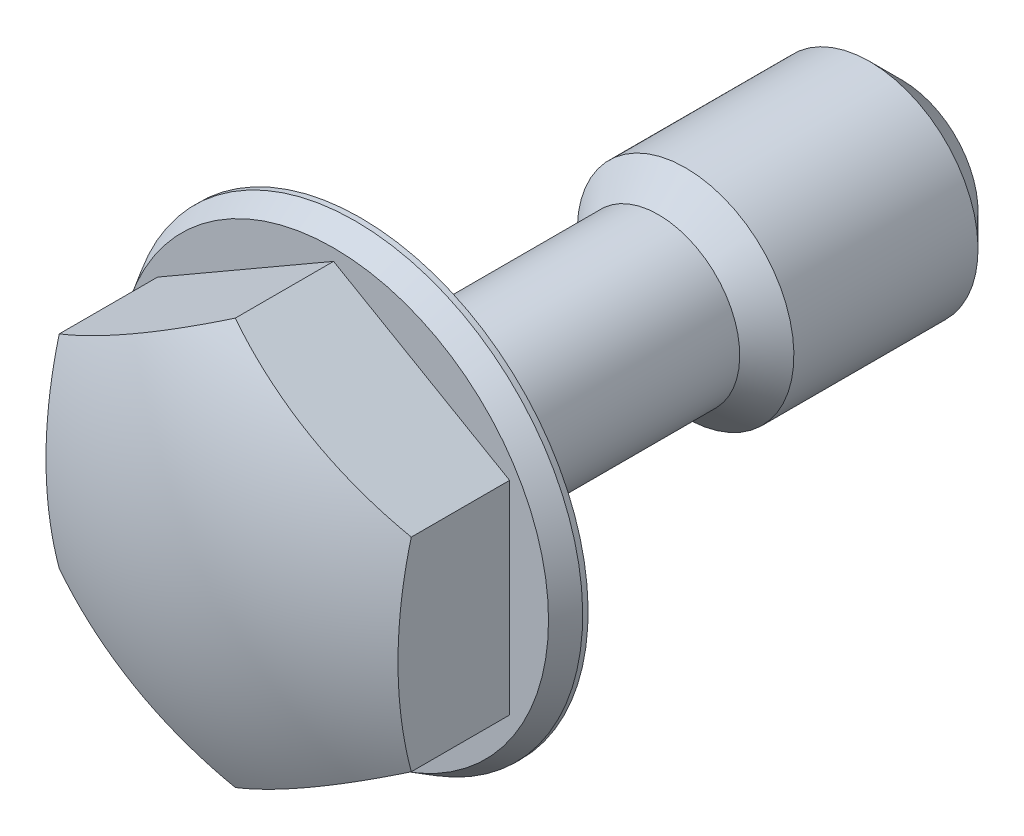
ISO-10303-21;
HEADER;
FILE_DESCRIPTION(('STEP AP214'),'2;1');
FILE_NAME('part.step','',(''),(''),'','','');
FILE_SCHEMA(('AUTOMOTIVE_DESIGN { 1 0 10303 214 1 1 1 1 }'));
ENDSEC;
DATA;
#1=APPLICATION_CONTEXT('core data for automotive mechanical design processes');
#2=APPLICATION_PROTOCOL_DEFINITION('international standard','automotive_design',2000,#1);
#3=PRODUCT_CONTEXT('',#1,'mechanical');
#4=PRODUCT('Part','Part','',(#3));
#5=PRODUCT_RELATED_PRODUCT_CATEGORY('part','',(#4));
#6=PRODUCT_DEFINITION_FORMATION('','',#4);
#7=PRODUCT_DEFINITION_CONTEXT('part definition',#1,'design');
#8=PRODUCT_DEFINITION('design','',#6,#7);
#9=PRODUCT_DEFINITION_SHAPE('','',#8);
#10=(LENGTH_UNIT() NAMED_UNIT(*) SI_UNIT(.MILLI.,.METRE.));
#11=(NAMED_UNIT(*) PLANE_ANGLE_UNIT() SI_UNIT($,.RADIAN.));
#12=(NAMED_UNIT(*) SI_UNIT($,.STERADIAN.) SOLID_ANGLE_UNIT());
#13=UNCERTAINTY_MEASURE_WITH_UNIT(LENGTH_MEASURE(1.E-05),#10,'distance_accuracy_value','');
#14=(GEOMETRIC_REPRESENTATION_CONTEXT(3) GLOBAL_UNCERTAINTY_ASSIGNED_CONTEXT((#13)) GLOBAL_UNIT_ASSIGNED_CONTEXT((#10,
#11,#12)) REPRESENTATION_CONTEXT('',''));
#15=CARTESIAN_POINT('',(0.,0.,0.));
#16=DIRECTION('',(0.,0.,1.));
#17=DIRECTION('',(1.,0.,0.));
#18=AXIS2_PLACEMENT_3D('',#15,#16,#17);
#19=CARTESIAN_POINT('',(0.,0.,1.));
#20=DIRECTION('',(0.,0.,-1.));
#21=DIRECTION('',(0.,1.,0.));
#22=AXIS2_PLACEMENT_3D('',#19,#20,#21);
#23=CONICAL_SURFACE('',#22,7.9381197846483,0.523598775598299);
#24=CARTESIAN_POINT('',(0.,0.,0.2));
#25=DIRECTION('',(0.,0.,-1.));
#26=DIRECTION('',(0.,1.,0.));
#27=AXIS2_PLACEMENT_3D('',#24,#25,#26);
#28=CIRCLE('',#27,8.4);
#29=CARTESIAN_POINT('',(0.,8.4,0.2));
#30=VERTEX_POINT('',#29);
#31=EDGE_CURVE('E117',#30,#30,#28,.T.);
#32=ORIENTED_EDGE('',*,*,#31,.F.);
#33=EDGE_LOOP('',(#32));
#34=FACE_BOUND('',#33,.T.);
#35=CARTESIAN_POINT('',(0.,0.,1.));
#36=DIRECTION('',(0.,0.,1.));
#37=DIRECTION('',(0.,-1.,0.));
#38=AXIS2_PLACEMENT_3D('',#35,#36,#37);
#39=CIRCLE('',#38,7.9381197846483);
#40=CARTESIAN_POINT('',(0.,-7.9381197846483,1.));
#41=VERTEX_POINT('',#40);
#42=EDGE_CURVE('E95',#41,#41,#39,.T.);
#43=ORIENTED_EDGE('',*,*,#42,.F.);
#44=EDGE_LOOP('',(#43));
#45=FACE_BOUND('',#44,.T.);
#46=ADVANCED_FACE('F14',(#34,#45),#23,.T.);
#47=CARTESIAN_POINT('',(0.,0.,-20.));
#48=DIRECTION('',(0.,0.,-1.));
#49=DIRECTION('',(0.,1.,0.));
#50=AXIS2_PLACEMENT_3D('',#47,#48,#49);
#51=CYLINDRICAL_SURFACE('',#50,8.4);
#52=CARTESIAN_POINT('',(0.,0.,0.));
#53=DIRECTION('',(0.,0.,-1.));
#54=DIRECTION('',(0.,1.,0.));
#55=AXIS2_PLACEMENT_3D('',#52,#53,#54);
#56=CIRCLE('',#55,8.4);
#57=CARTESIAN_POINT('',(0.,8.4,0.));
#58=VERTEX_POINT('',#57);
#59=EDGE_CURVE('E114',#58,#58,#56,.T.);
#60=ORIENTED_EDGE('',*,*,#59,.F.);
#61=EDGE_LOOP('',(#60));
#62=FACE_BOUND('',#61,.T.);
#63=ORIENTED_EDGE('',*,*,#31,.T.);
#64=EDGE_LOOP('',(#63));
#65=FACE_BOUND('',#64,.T.);
#66=ADVANCED_FACE('F150',(#62,#65),#51,.T.);
#67=CARTESIAN_POINT('',(8.4,0.,0.));
#68=DIRECTION('',(0.,0.,1.));
#69=DIRECTION('',(0.,-1.,0.));
#70=AXIS2_PLACEMENT_3D('',#67,#68,#69);
#71=PLANE('',#70);
#72=CARTESIAN_POINT('',(0.,0.,0.));
#73=DIRECTION('',(0.,0.,-1.));
#74=DIRECTION('',(0.,1.,0.));
#75=AXIS2_PLACEMENT_3D('',#72,#73,#74);
#76=CIRCLE('',#75,3.6);
#77=CARTESIAN_POINT('',(0.,3.6,0.));
#78=VERTEX_POINT('',#77);
#79=EDGE_CURVE('E111',#78,#78,#76,.T.);
#80=ORIENTED_EDGE('',*,*,#79,.F.);
#81=EDGE_LOOP('',(#80));
#82=FACE_BOUND('',#81,.T.);
#83=ORIENTED_EDGE('',*,*,#59,.T.);
#84=EDGE_LOOP('',(#83));
#85=FACE_BOUND('',#84,.T.);
#86=ADVANCED_FACE('F156',(#82,#85),#71,.F.);
#87=CARTESIAN_POINT('',(0.,0.,-0.6));
#88=DIRECTION('',(0.,0.,-1.));
#89=DIRECTION('',(0.,1.,0.));
#90=AXIS2_PLACEMENT_3D('',#87,#88,#89);
#91=TOROIDAL_SURFACE('',#90,3.6,0.6);
#92=CARTESIAN_POINT('',(0.,0.,-0.6));
#93=DIRECTION('',(0.,0.,-1.));
#94=DIRECTION('',(0.,1.,0.));
#95=AXIS2_PLACEMENT_3D('',#92,#93,#94);
#96=CIRCLE('',#95,3.);
#97=CARTESIAN_POINT('',(0.,3.,-0.6));
#98=VERTEX_POINT('',#97);
#99=EDGE_CURVE('E108',#98,#98,#96,.T.);
#100=ORIENTED_EDGE('',*,*,#99,.F.);
#101=EDGE_LOOP('',(#100));
#102=FACE_BOUND('',#101,.T.);
#103=ORIENTED_EDGE('',*,*,#79,.T.);
#104=EDGE_LOOP('',(#103));
#105=FACE_BOUND('',#104,.T.);
#106=ADVANCED_FACE('F194',(#102,#105),#91,.F.);
#107=CARTESIAN_POINT('',(0.,0.,-20.));
#108=DIRECTION('',(0.,0.,-1.));
#109=DIRECTION('',(0.,1.,0.));
#110=AXIS2_PLACEMENT_3D('',#107,#108,#109);
#111=CYLINDRICAL_SURFACE('',#110,3.);
#112=CARTESIAN_POINT('',(0.,0.,-11.));
#113=DIRECTION('',(0.,0.,-1.));
#114=DIRECTION('',(0.,1.,0.));
#115=AXIS2_PLACEMENT_3D('',#112,#113,#114);
#116=CIRCLE('',#115,3.);
#117=CARTESIAN_POINT('',(0.,3.,-11.));
#118=VERTEX_POINT('',#117);
#119=EDGE_CURVE('E83',#118,#118,#116,.T.);
#120=ORIENTED_EDGE('',*,*,#119,.F.);
#121=EDGE_LOOP('',(#120));
#122=FACE_BOUND('',#121,.T.);
#123=ORIENTED_EDGE('',*,*,#99,.T.);
#124=EDGE_LOOP('',(#123));
#125=FACE_BOUND('',#124,.T.);
#126=ADVANCED_FACE('F191',(#122,#125),#111,.T.);
#127=CARTESIAN_POINT('',(0.,0.,1.));
#128=DIRECTION('',(0.,0.,1.));
#129=DIRECTION('',(0.,-1.,0.));
#130=AXIS2_PLACEMENT_3D('',#127,#128,#129);
#131=PLANE('',#130);
#132=DIRECTION('',(0.,-1.,0.));
#133=VECTOR('',#132,1.);
#134=CARTESIAN_POINT('',(-6.5,3.75277674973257,1.));
#135=LINE('',#134,#133);
#136=CARTESIAN_POINT('',(-6.5,3.75277674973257,1.));
#137=VERTEX_POINT('',#136);
#138=CARTESIAN_POINT('',(-6.5,-3.75277674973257,1.));
#139=VERTEX_POINT('',#138);
#140=EDGE_CURVE('E72',#137,#139,#135,.T.);
#141=ORIENTED_EDGE('',*,*,#140,.F.);
#142=DIRECTION('',(-0.866025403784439,-0.5,0.));
#143=VECTOR('',#142,1.);
#144=CARTESIAN_POINT('',(0.,7.50555349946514,1.));
#145=LINE('',#144,#143);
#146=CARTESIAN_POINT('',(0.,7.50555349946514,1.));
#147=VERTEX_POINT('',#146);
#148=EDGE_CURVE('E88',#147,#137,#145,.T.);
#149=ORIENTED_EDGE('',*,*,#148,.F.);
#150=DIRECTION('',(-0.866025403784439,0.5,0.));
#151=VECTOR('',#150,1.);
#152=CARTESIAN_POINT('',(6.5,3.75277674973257,1.));
#153=LINE('',#152,#151);
#154=CARTESIAN_POINT('',(6.5,3.75277674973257,1.));
#155=VERTEX_POINT('',#154);
#156=EDGE_CURVE('E90',#155,#147,#153,.T.);
#157=ORIENTED_EDGE('',*,*,#156,.F.);
#158=DIRECTION('',(0.,1.,0.));
#159=VECTOR('',#158,1.);
#160=CARTESIAN_POINT('',(6.5,-3.75277674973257,1.));
#161=LINE('',#160,#159);
#162=CARTESIAN_POINT('',(6.5,-3.75277674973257,1.));
#163=VERTEX_POINT('',#162);
#164=EDGE_CURVE('E183',#163,#155,#161,.T.);
#165=ORIENTED_EDGE('',*,*,#164,.F.);
#166=DIRECTION('',(0.866025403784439,0.5,0.));
#167=VECTOR('',#166,1.);
#168=CARTESIAN_POINT('',(0.,-7.50555349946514,1.));
#169=LINE('',#168,#167);
#170=CARTESIAN_POINT('',(0.,-7.50555349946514,1.));
#171=VERTEX_POINT('',#170);
#172=EDGE_CURVE('E82',#171,#163,#169,.T.);
#173=ORIENTED_EDGE('',*,*,#172,.F.);
#174=DIRECTION('',(0.866025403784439,-0.5,0.));
#175=VECTOR('',#174,1.);
#176=CARTESIAN_POINT('',(-6.5,-3.75277674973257,1.));
#177=LINE('',#176,#175);
#178=EDGE_CURVE('E68',#139,#171,#177,.T.);
#179=ORIENTED_EDGE('',*,*,#178,.F.);
#180=EDGE_LOOP('',(#141,#149,#157,#165,#173,#179));
#181=FACE_BOUND('',#180,.T.);
#182=ORIENTED_EDGE('',*,*,#42,.T.);
#183=EDGE_LOOP('',(#182));
#184=FACE_BOUND('',#183,.T.);
#185=ADVANCED_FACE('F77',(#181,#184),#131,.T.);
#186=CARTESIAN_POINT('',(-6.5,3.75277674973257,1.));
#187=DIRECTION('',(-1.,0.,0.));
#188=DIRECTION('',(0.,-1.,0.));
#189=AXIS2_PLACEMENT_3D('',#186,#187,#188);
#190=PLANE('',#189);
#191=DIRECTION('',(0.,0.,1.));
#192=VECTOR('',#191,1.);
#193=CARTESIAN_POINT('',(-6.5,3.75277674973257,1.));
#194=LINE('',#193,#192);
#195=CARTESIAN_POINT('',(-6.5,3.75277674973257,4.6303455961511));
#196=VERTEX_POINT('',#195);
#197=EDGE_CURVE('E86',#137,#196,#194,.T.);
#198=ORIENTED_EDGE('',*,*,#197,.F.);
#199=ORIENTED_EDGE('',*,*,#140,.T.);
#200=DIRECTION('',(0.,0.,1.));
#201=VECTOR('',#200,1.);
#202=CARTESIAN_POINT('',(-6.5,-3.75277674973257,1.));
#203=LINE('',#202,#201);
#204=CARTESIAN_POINT('',(-6.5,-3.75277674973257,4.6303455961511));
#205=VERTEX_POINT('',#204);
#206=EDGE_CURVE('E65',#139,#205,#203,.T.);
#207=ORIENTED_EDGE('',*,*,#206,.T.);
#208=CARTESIAN_POINT('',(-6.5,0.,-9.5));
#209=DIRECTION('',(-1.,0.,0.));
#210=DIRECTION('',(0.,-1.,0.));
#211=AXIS2_PLACEMENT_3D('',#208,#209,#210);
#212=CIRCLE('',#211,14.6201915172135);
#213=EDGE_CURVE('E37',#196,#205,#212,.F.);
#214=ORIENTED_EDGE('',*,*,#213,.F.);
#215=EDGE_LOOP('',(#198,#199,#207,#214));
#216=FACE_BOUND('',#215,.T.);
#217=ADVANCED_FACE('F85',(#216),#190,.T.);
#218=CARTESIAN_POINT('',(0.,7.50555349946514,1.));
#219=DIRECTION('',(-0.5,0.866025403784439,0.));
#220=DIRECTION('',(-0.866025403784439,-0.5,0.));
#221=AXIS2_PLACEMENT_3D('',#218,#219,#220);
#222=PLANE('',#221);
#223=DIRECTION('',(0.,0.,1.));
#224=VECTOR('',#223,1.);
#225=CARTESIAN_POINT('',(0.,7.50555349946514,1.));
#226=LINE('',#225,#224);
#227=CARTESIAN_POINT('',(0.,7.50555349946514,4.6303455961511));
#228=VERTEX_POINT('',#227);
#229=EDGE_CURVE('E96',#147,#228,#226,.T.);
#230=ORIENTED_EDGE('',*,*,#229,.F.);
#231=ORIENTED_EDGE('',*,*,#148,.T.);
#232=ORIENTED_EDGE('',*,*,#197,.T.);
#233=CARTESIAN_POINT('',(-3.25,5.62916512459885,-9.5));
#234=DIRECTION('',(-0.5,0.866025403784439,0.));
#235=DIRECTION('',(-0.866025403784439,-0.5,0.));
#236=AXIS2_PLACEMENT_3D('',#233,#234,#235);
#237=CIRCLE('',#236,14.6201915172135);
#238=EDGE_CURVE('E130',#228,#196,#237,.F.);
#239=ORIENTED_EDGE('',*,*,#238,.F.);
#240=EDGE_LOOP('',(#230,#231,#232,#239));
#241=FACE_BOUND('',#240,.T.);
#242=ADVANCED_FACE('F217',(#241),#222,.T.);
#243=CARTESIAN_POINT('',(6.5,3.75277674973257,1.));
#244=DIRECTION('',(0.5,0.866025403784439,0.));
#245=DIRECTION('',(-0.866025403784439,0.5,0.));
#246=AXIS2_PLACEMENT_3D('',#243,#244,#245);
#247=PLANE('',#246);
#248=DIRECTION('',(0.,0.,1.));
#249=VECTOR('',#248,1.);
#250=CARTESIAN_POINT('',(6.5,3.75277674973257,1.));
#251=LINE('',#250,#249);
#252=CARTESIAN_POINT('',(6.5,3.75277674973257,4.6303455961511));
#253=VERTEX_POINT('',#252);
#254=EDGE_CURVE('E99',#155,#253,#251,.T.);
#255=ORIENTED_EDGE('',*,*,#254,.F.);
#256=ORIENTED_EDGE('',*,*,#156,.T.);
#257=ORIENTED_EDGE('',*,*,#229,.T.);
#258=CARTESIAN_POINT('',(3.25,5.62916512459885,-9.5));
#259=DIRECTION('',(0.5,0.866025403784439,0.));
#260=DIRECTION('',(-0.866025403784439,0.5,0.));
#261=AXIS2_PLACEMENT_3D('',#258,#259,#260);
#262=CIRCLE('',#261,14.6201915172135);
#263=EDGE_CURVE('E127',#253,#228,#262,.F.);
#264=ORIENTED_EDGE('',*,*,#263,.F.);
#265=EDGE_LOOP('',(#255,#256,#257,#264));
#266=FACE_BOUND('',#265,.T.);
#267=ADVANCED_FACE('F177',(#266),#247,.T.);
#268=CARTESIAN_POINT('',(6.5,-3.75277674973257,1.));
#269=DIRECTION('',(1.,0.,0.));
#270=DIRECTION('',(0.,1.,0.));
#271=AXIS2_PLACEMENT_3D('',#268,#269,#270);
#272=PLANE('',#271);
#273=DIRECTION('',(0.,0.,1.));
#274=VECTOR('',#273,1.);
#275=CARTESIAN_POINT('',(6.5,-3.75277674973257,1.));
#276=LINE('',#275,#274);
#277=CARTESIAN_POINT('',(6.5,-3.75277674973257,4.6303455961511));
#278=VERTEX_POINT('',#277);
#279=EDGE_CURVE('E102',#163,#278,#276,.T.);
#280=ORIENTED_EDGE('',*,*,#279,.F.);
#281=ORIENTED_EDGE('',*,*,#164,.T.);
#282=ORIENTED_EDGE('',*,*,#254,.T.);
#283=CARTESIAN_POINT('',(6.5,0.,-9.5));
#284=DIRECTION('',(1.,0.,0.));
#285=DIRECTION('',(0.,1.,0.));
#286=AXIS2_PLACEMENT_3D('',#283,#284,#285);
#287=CIRCLE('',#286,14.6201915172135);
#288=EDGE_CURVE('E124',#278,#253,#287,.F.);
#289=ORIENTED_EDGE('',*,*,#288,.F.);
#290=EDGE_LOOP('',(#280,#281,#282,#289));
#291=FACE_BOUND('',#290,.T.);
#292=ADVANCED_FACE('F182',(#291),#272,.T.);
#293=CARTESIAN_POINT('',(0.,-7.50555349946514,1.));
#294=DIRECTION('',(0.5,-0.866025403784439,0.));
#295=DIRECTION('',(0.866025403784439,0.5,0.));
#296=AXIS2_PLACEMENT_3D('',#293,#294,#295);
#297=PLANE('',#296);
#298=DIRECTION('',(0.,0.,1.));
#299=VECTOR('',#298,1.);
#300=CARTESIAN_POINT('',(0.,-7.50555349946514,1.));
#301=LINE('',#300,#299);
#302=CARTESIAN_POINT('',(0.,-7.50555349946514,4.6303455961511));
#303=VERTEX_POINT('',#302);
#304=EDGE_CURVE('E29',#171,#303,#301,.T.);
#305=ORIENTED_EDGE('',*,*,#304,.F.);
#306=ORIENTED_EDGE('',*,*,#172,.T.);
#307=ORIENTED_EDGE('',*,*,#279,.T.);
#308=CARTESIAN_POINT('',(3.25,-5.62916512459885,-9.5));
#309=DIRECTION('',(0.5,-0.866025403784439,0.));
#310=DIRECTION('',(0.866025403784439,0.5,0.));
#311=AXIS2_PLACEMENT_3D('',#308,#309,#310);
#312=CIRCLE('',#311,14.6201915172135);
#313=EDGE_CURVE('E121',#303,#278,#312,.F.);
#314=ORIENTED_EDGE('',*,*,#313,.F.);
#315=EDGE_LOOP('',(#305,#306,#307,#314));
#316=FACE_BOUND('',#315,.T.);
#317=ADVANCED_FACE('F173',(#316),#297,.T.);
#318=CARTESIAN_POINT('',(-6.5,-3.75277674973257,1.));
#319=DIRECTION('',(-0.5,-0.866025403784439,0.));
#320=DIRECTION('',(0.866025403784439,-0.5,0.));
#321=AXIS2_PLACEMENT_3D('',#318,#319,#320);
#322=PLANE('',#321);
#323=ORIENTED_EDGE('',*,*,#206,.F.);
#324=ORIENTED_EDGE('',*,*,#178,.T.);
#325=ORIENTED_EDGE('',*,*,#304,.T.);
#326=CARTESIAN_POINT('',(-3.25,-5.62916512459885,-9.5));
#327=DIRECTION('',(-0.5,-0.866025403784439,0.));
#328=DIRECTION('',(0.866025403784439,-0.5,0.));
#329=AXIS2_PLACEMENT_3D('',#326,#327,#328);
#330=CIRCLE('',#329,14.6201915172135);
#331=EDGE_CURVE('E70',#205,#303,#330,.F.);
#332=ORIENTED_EDGE('',*,*,#331,.F.);
#333=EDGE_LOOP('',(#323,#324,#325,#332));
#334=FACE_BOUND('',#333,.T.);
#335=ADVANCED_FACE('F67',(#334),#322,.T.);
#336=CARTESIAN_POINT('',(0.,0.,-9.5));
#337=DIRECTION('',(0.,0.,-1.));
#338=DIRECTION('',(1.,0.,0.));
#339=AXIS2_PLACEMENT_3D('',#336,#337,#338);
#340=SPHERICAL_SURFACE('',#339,16.);
#341=ORIENTED_EDGE('',*,*,#263,.T.);
#342=ORIENTED_EDGE('',*,*,#238,.T.);
#343=ORIENTED_EDGE('',*,*,#213,.T.);
#344=ORIENTED_EDGE('',*,*,#331,.T.);
#345=ORIENTED_EDGE('',*,*,#313,.T.);
#346=ORIENTED_EDGE('',*,*,#288,.T.);
#347=EDGE_LOOP('',(#341,#342,#343,#344,#345,#346));
#348=FACE_BOUND('',#347,.T.);
#349=ADVANCED_FACE('F163',(#348),#340,.T.);
#350=CARTESIAN_POINT('',(0.,0.,-20.));
#351=DIRECTION('',(0.,0.,1.));
#352=DIRECTION('',(0.,-1.,0.));
#353=AXIS2_PLACEMENT_3D('',#350,#351,#352);
#354=CYLINDRICAL_SURFACE('',#353,4.);
#355=CARTESIAN_POINT('',(0.,0.,-18.8));
#356=DIRECTION('',(0.,0.,-1.));
#357=DIRECTION('',(0.,1.,0.));
#358=AXIS2_PLACEMENT_3D('',#355,#356,#357);
#359=CIRCLE('',#358,4.);
#360=CARTESIAN_POINT('',(0.,4.,-18.8));
#361=VERTEX_POINT('',#360);
#362=EDGE_CURVE('E9',#361,#361,#359,.F.);
#363=ORIENTED_EDGE('',*,*,#362,.T.);
#364=EDGE_LOOP('',(#363));
#365=FACE_BOUND('',#364,.T.);
#366=CARTESIAN_POINT('',(0.,0.,-12.));
#367=DIRECTION('',(0.,0.,-1.));
#368=DIRECTION('',(0.,1.,0.));
#369=AXIS2_PLACEMENT_3D('',#366,#367,#368);
#370=CIRCLE('',#369,4.);
#371=CARTESIAN_POINT('',(0.,4.,-12.));
#372=VERTEX_POINT('',#371);
#373=EDGE_CURVE('E133',#372,#372,#370,.T.);
#374=ORIENTED_EDGE('',*,*,#373,.T.);
#375=EDGE_LOOP('',(#374));
#376=FACE_BOUND('',#375,.T.);
#377=ADVANCED_FACE('F165',(#365,#376),#354,.T.);
#378=CARTESIAN_POINT('',(0.,0.,-20.));
#379=DIRECTION('',(0.,0.,-1.));
#380=DIRECTION('',(0.,1.,0.));
#381=AXIS2_PLACEMENT_3D('',#378,#379,#380);
#382=PLANE('',#381);
#383=CARTESIAN_POINT('',(0.,0.,-20.));
#384=DIRECTION('',(0.,0.,-1.));
#385=DIRECTION('',(0.,1.,0.));
#386=AXIS2_PLACEMENT_3D('',#383,#384,#385);
#387=CIRCLE('',#386,2.8);
#388=CARTESIAN_POINT('',(0.,2.8,-20.));
#389=VERTEX_POINT('',#388);
#390=EDGE_CURVE('E22',#389,#389,#387,.T.);
#391=ORIENTED_EDGE('',*,*,#390,.T.);
#392=EDGE_LOOP('',(#391));
#393=FACE_BOUND('',#392,.T.);
#394=ADVANCED_FACE('F138',(#393),#382,.T.);
#395=CARTESIAN_POINT('',(0.,0.,-12.));
#396=DIRECTION('',(0.,0.,-1.));
#397=DIRECTION('',(0.,1.,0.));
#398=AXIS2_PLACEMENT_3D('',#395,#396,#397);
#399=CONICAL_SURFACE('',#398,4.,0.78539816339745);
#400=ORIENTED_EDGE('',*,*,#119,.T.);
#401=EDGE_LOOP('',(#400));
#402=FACE_BOUND('',#401,.T.);
#403=ORIENTED_EDGE('',*,*,#373,.F.);
#404=EDGE_LOOP('',(#403));
#405=FACE_BOUND('',#404,.T.);
#406=ADVANCED_FACE('F141',(#402,#405),#399,.T.);
#407=CARTESIAN_POINT('',(0.,0.,-20.));
#408=DIRECTION('',(0.,0.,1.));
#409=DIRECTION('',(0.,-1.,0.));
#410=AXIS2_PLACEMENT_3D('',#407,#408,#409);
#411=CONICAL_SURFACE('',#410,2.8,0.785398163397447);
#412=ORIENTED_EDGE('',*,*,#362,.F.);
#413=EDGE_LOOP('',(#412));
#414=FACE_BOUND('',#413,.T.);
#415=ORIENTED_EDGE('',*,*,#390,.F.);
#416=EDGE_LOOP('',(#415));
#417=FACE_BOUND('',#416,.T.);
#418=ADVANCED_FACE('F16',(#414,#417),#411,.T.);
#419=CLOSED_SHELL('',(#46,#66,#86,#106,#126,#185,#217,#242,#267,#292,#317,#335,#349,#377,#394,
#406,#418));
#420=MANIFOLD_SOLID_BREP('B1',#419);
#421=ADVANCED_BREP_SHAPE_REPRESENTATION('',(#18,#420),#14);
#422=SHAPE_DEFINITION_REPRESENTATION(#9,#421);
ENDSEC;
END-ISO-10303-21;
